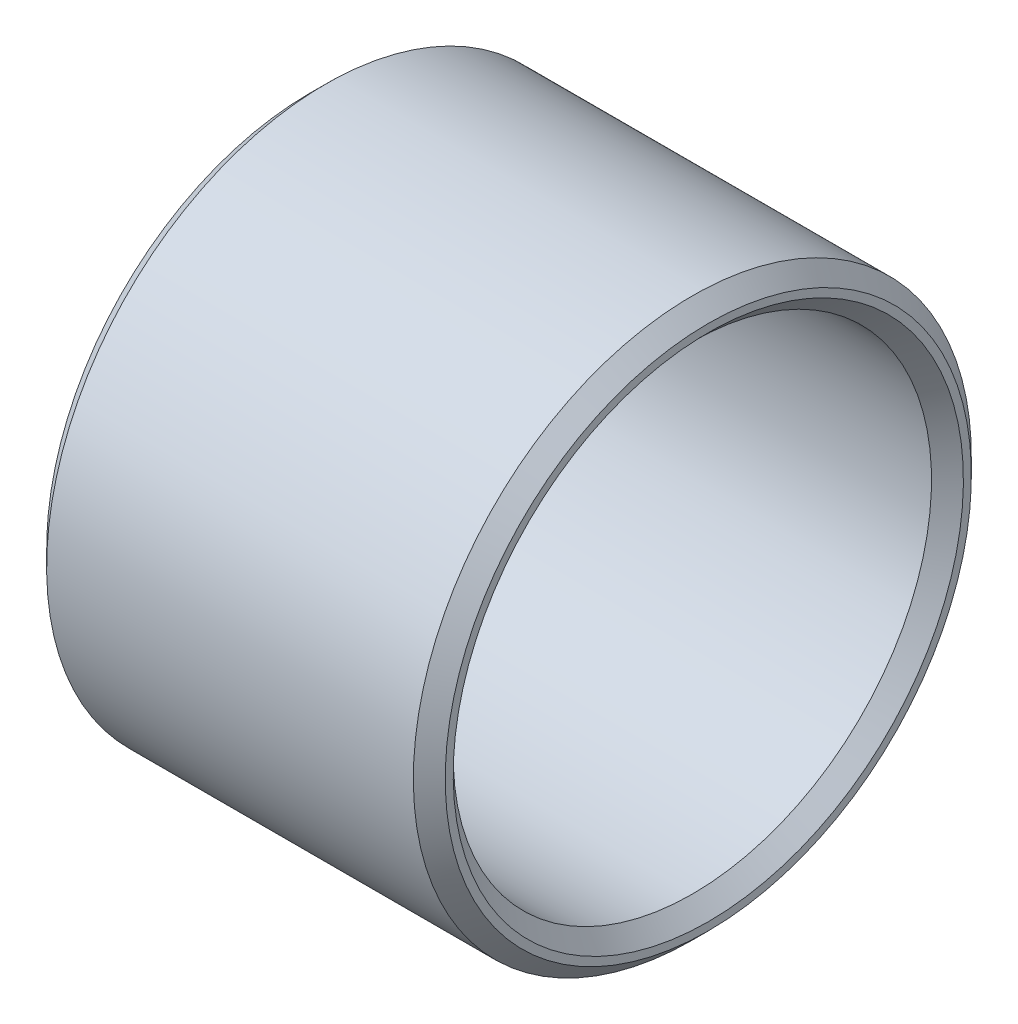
ISO-10303-21;
HEADER;
FILE_DESCRIPTION(('STEP AP214'),'2;1');
FILE_NAME('part.step','',(''),(''),'','','');
FILE_SCHEMA(('AUTOMOTIVE_DESIGN { 1 0 10303 214 1 1 1 1 }'));
ENDSEC;
DATA;
#1=APPLICATION_CONTEXT('core data for automotive mechanical design processes');
#2=APPLICATION_PROTOCOL_DEFINITION('international standard','automotive_design',2000,#1);
#3=PRODUCT_CONTEXT('',#1,'mechanical');
#4=PRODUCT('Part','Part','',(#3));
#5=PRODUCT_RELATED_PRODUCT_CATEGORY('part','',(#4));
#6=PRODUCT_DEFINITION_FORMATION('','',#4);
#7=PRODUCT_DEFINITION_CONTEXT('part definition',#1,'design');
#8=PRODUCT_DEFINITION('design','',#6,#7);
#9=PRODUCT_DEFINITION_SHAPE('','',#8);
#10=(LENGTH_UNIT() NAMED_UNIT(*) SI_UNIT(.MILLI.,.METRE.));
#11=(NAMED_UNIT(*) PLANE_ANGLE_UNIT() SI_UNIT($,.RADIAN.));
#12=(NAMED_UNIT(*) SI_UNIT($,.STERADIAN.) SOLID_ANGLE_UNIT());
#13=UNCERTAINTY_MEASURE_WITH_UNIT(LENGTH_MEASURE(1.E-05),#10,'distance_accuracy_value','');
#14=(GEOMETRIC_REPRESENTATION_CONTEXT(3) GLOBAL_UNCERTAINTY_ASSIGNED_CONTEXT((#13)) GLOBAL_UNIT_ASSIGNED_CONTEXT((#10,
#11,#12)) REPRESENTATION_CONTEXT('',''));
#15=CARTESIAN_POINT('',(0.,0.,0.));
#16=DIRECTION('',(0.,0.,1.));
#17=DIRECTION('',(1.,0.,0.));
#18=AXIS2_PLACEMENT_3D('',#15,#16,#17);
#19=CARTESIAN_POINT('',(0.,-6.5,0.));
#20=DIRECTION('',(-1.,0.,0.));
#21=DIRECTION('',(0.,1.,0.));
#22=AXIS2_PLACEMENT_3D('',#19,#20,#21);
#23=PLANE('',#22);
#24=CARTESIAN_POINT('',(0.,0.,0.));
#25=DIRECTION('',(1.,0.,0.));
#26=DIRECTION('',(0.,-1.,0.));
#27=AXIS2_PLACEMENT_3D('',#24,#25,#26);
#28=CIRCLE('',#27,6.4);
#29=CARTESIAN_POINT('',(0.,-6.4,0.));
#30=VERTEX_POINT('',#29);
#31=EDGE_CURVE('E9',#30,#30,#28,.T.);
#32=ORIENTED_EDGE('',*,*,#31,.T.);
#33=EDGE_LOOP('',(#32));
#34=FACE_BOUND('',#33,.T.);
#35=CARTESIAN_POINT('',(0.,0.,0.));
#36=DIRECTION('',(1.,0.,0.));
#37=DIRECTION('',(0.,-1.,0.));
#38=AXIS2_PLACEMENT_3D('',#35,#36,#37);
#39=CIRCLE('',#38,6.6);
#40=CARTESIAN_POINT('',(0.,-6.6,0.));
#41=VERTEX_POINT('',#40);
#42=EDGE_CURVE('E53',#41,#41,#39,.T.);
#43=ORIENTED_EDGE('',*,*,#42,.F.);
#44=EDGE_LOOP('',(#43));
#45=FACE_BOUND('',#44,.T.);
#46=ADVANCED_FACE('F15',(#34,#45),#23,.T.);
#47=CARTESIAN_POINT('',(0.2,0.,0.));
#48=DIRECTION('',(-1.,0.,0.));
#49=DIRECTION('',(0.,-1.,0.));
#50=AXIS2_PLACEMENT_3D('',#47,#48,#49);
#51=CONICAL_SURFACE('',#50,6.2,0.785398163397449);
#52=CARTESIAN_POINT('',(0.4,0.,0.));
#53=DIRECTION('',(1.,0.,0.));
#54=DIRECTION('',(0.,-1.,0.));
#55=AXIS2_PLACEMENT_3D('',#52,#53,#54);
#56=CIRCLE('',#55,6.);
#57=CARTESIAN_POINT('',(0.4,-6.,0.));
#58=VERTEX_POINT('',#57);
#59=EDGE_CURVE('E22',#58,#58,#56,.T.);
#60=ORIENTED_EDGE('',*,*,#59,.T.);
#61=EDGE_LOOP('',(#60));
#62=FACE_BOUND('',#61,.T.);
#63=ORIENTED_EDGE('',*,*,#31,.F.);
#64=EDGE_LOOP('',(#63));
#65=FACE_BOUND('',#64,.T.);
#66=ADVANCED_FACE('F82',(#62,#65),#51,.F.);
#67=CARTESIAN_POINT('',(5.,0.,0.));
#68=DIRECTION('',(-1.,0.,0.));
#69=DIRECTION('',(0.,-1.,0.));
#70=AXIS2_PLACEMENT_3D('',#67,#68,#69);
#71=CYLINDRICAL_SURFACE('',#70,6.);
#72=CARTESIAN_POINT('',(9.6,0.,0.));
#73=DIRECTION('',(1.,0.,0.));
#74=DIRECTION('',(0.,-1.,0.));
#75=AXIS2_PLACEMENT_3D('',#72,#73,#74);
#76=CIRCLE('',#75,6.);
#77=CARTESIAN_POINT('',(9.6,-6.,0.));
#78=VERTEX_POINT('',#77);
#79=EDGE_CURVE('E58',#78,#78,#76,.T.);
#80=ORIENTED_EDGE('',*,*,#79,.T.);
#81=EDGE_LOOP('',(#80));
#82=FACE_BOUND('',#81,.T.);
#83=ORIENTED_EDGE('',*,*,#59,.F.);
#84=EDGE_LOOP('',(#83));
#85=FACE_BOUND('',#84,.T.);
#86=ADVANCED_FACE('F66',(#82,#85),#71,.F.);
#87=CARTESIAN_POINT('',(9.8,0.,0.));
#88=DIRECTION('',(1.,0.,0.));
#89=DIRECTION('',(0.,-1.,0.));
#90=AXIS2_PLACEMENT_3D('',#87,#88,#89);
#91=CONICAL_SURFACE('',#90,6.2,0.785398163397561);
#92=CARTESIAN_POINT('',(10.,0.,0.));
#93=DIRECTION('',(1.,0.,0.));
#94=DIRECTION('',(0.,-1.,0.));
#95=AXIS2_PLACEMENT_3D('',#92,#93,#94);
#96=CIRCLE('',#95,6.40000000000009);
#97=CARTESIAN_POINT('',(10.,-6.40000000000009,0.));
#98=VERTEX_POINT('',#97);
#99=EDGE_CURVE('E63',#98,#98,#96,.T.);
#100=ORIENTED_EDGE('',*,*,#99,.T.);
#101=EDGE_LOOP('',(#100));
#102=FACE_BOUND('',#101,.T.);
#103=ORIENTED_EDGE('',*,*,#79,.F.);
#104=EDGE_LOOP('',(#103));
#105=FACE_BOUND('',#104,.T.);
#106=ADVANCED_FACE('F69',(#102,#105),#91,.F.);
#107=CARTESIAN_POINT('',(10.,-6.50000000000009,0.));
#108=DIRECTION('',(1.,0.,0.));
#109=DIRECTION('',(0.,-1.,0.));
#110=AXIS2_PLACEMENT_3D('',#107,#108,#109);
#111=PLANE('',#110);
#112=CARTESIAN_POINT('',(10.,0.,0.));
#113=DIRECTION('',(1.,0.,0.));
#114=DIRECTION('',(0.,-1.,0.));
#115=AXIS2_PLACEMENT_3D('',#112,#113,#114);
#116=CIRCLE('',#115,6.60000000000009);
#117=CARTESIAN_POINT('',(10.,-6.60000000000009,0.));
#118=VERTEX_POINT('',#117);
#119=EDGE_CURVE('E61',#118,#118,#116,.T.);
#120=ORIENTED_EDGE('',*,*,#119,.T.);
#121=EDGE_LOOP('',(#120));
#122=FACE_BOUND('',#121,.T.);
#123=ORIENTED_EDGE('',*,*,#99,.F.);
#124=EDGE_LOOP('',(#123));
#125=FACE_BOUND('',#124,.T.);
#126=ADVANCED_FACE('F71',(#122,#125),#111,.T.);
#127=CARTESIAN_POINT('',(9.8,0.,0.));
#128=DIRECTION('',(-1.,0.,0.));
#129=DIRECTION('',(0.,-1.,0.));
#130=AXIS2_PLACEMENT_3D('',#127,#128,#129);
#131=CONICAL_SURFACE('',#130,6.8,0.785398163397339);
#132=CARTESIAN_POINT('',(9.6,0.,0.));
#133=DIRECTION('',(1.,0.,0.));
#134=DIRECTION('',(0.,-1.,0.));
#135=AXIS2_PLACEMENT_3D('',#132,#133,#134);
#136=CIRCLE('',#135,7.);
#137=CARTESIAN_POINT('',(9.6,-7.,0.));
#138=VERTEX_POINT('',#137);
#139=EDGE_CURVE('E55',#138,#138,#136,.T.);
#140=ORIENTED_EDGE('',*,*,#139,.T.);
#141=EDGE_LOOP('',(#140));
#142=FACE_BOUND('',#141,.T.);
#143=ORIENTED_EDGE('',*,*,#119,.F.);
#144=EDGE_LOOP('',(#143));
#145=FACE_BOUND('',#144,.T.);
#146=ADVANCED_FACE('F79',(#142,#145),#131,.T.);
#147=CARTESIAN_POINT('',(5.,0.,0.));
#148=DIRECTION('',(-1.,0.,0.));
#149=DIRECTION('',(0.,-1.,0.));
#150=AXIS2_PLACEMENT_3D('',#147,#148,#149);
#151=CYLINDRICAL_SURFACE('',#150,7.);
#152=CARTESIAN_POINT('',(0.4,0.,0.));
#153=DIRECTION('',(1.,0.,0.));
#154=DIRECTION('',(0.,-1.,0.));
#155=AXIS2_PLACEMENT_3D('',#152,#153,#154);
#156=CIRCLE('',#155,7.);
#157=CARTESIAN_POINT('',(0.4,-7.,0.));
#158=VERTEX_POINT('',#157);
#159=EDGE_CURVE('E49',#158,#158,#156,.T.);
#160=ORIENTED_EDGE('',*,*,#159,.T.);
#161=EDGE_LOOP('',(#160));
#162=FACE_BOUND('',#161,.T.);
#163=ORIENTED_EDGE('',*,*,#139,.F.);
#164=EDGE_LOOP('',(#163));
#165=FACE_BOUND('',#164,.T.);
#166=ADVANCED_FACE('F50',(#162,#165),#151,.T.);
#167=CARTESIAN_POINT('',(0.2,0.,0.));
#168=DIRECTION('',(1.,0.,0.));
#169=DIRECTION('',(0.,-1.,0.));
#170=AXIS2_PLACEMENT_3D('',#167,#168,#169);
#171=CONICAL_SURFACE('',#170,6.8,0.78539816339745);
#172=ORIENTED_EDGE('',*,*,#42,.T.);
#173=EDGE_LOOP('',(#172));
#174=FACE_BOUND('',#173,.T.);
#175=ORIENTED_EDGE('',*,*,#159,.F.);
#176=EDGE_LOOP('',(#175));
#177=FACE_BOUND('',#176,.T.);
#178=ADVANCED_FACE('F92',(#174,#177),#171,.T.);
#179=CLOSED_SHELL('',(#46,#66,#86,#106,#126,#146,#166,#178));
#180=MANIFOLD_SOLID_BREP('B1',#179);
#181=ADVANCED_BREP_SHAPE_REPRESENTATION('',(#18,#180),#14);
#182=SHAPE_DEFINITION_REPRESENTATION(#9,#181);
ENDSEC;
END-ISO-10303-21;
